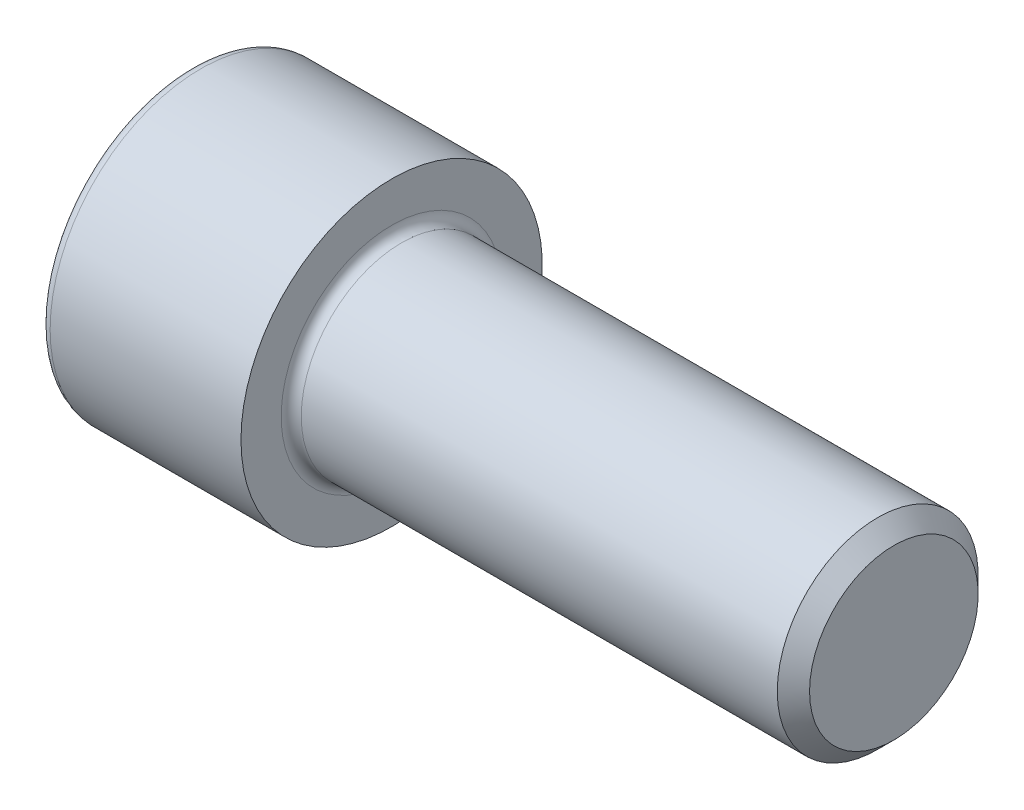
ISO-10303-21;
HEADER;
FILE_DESCRIPTION(('STEP AP214'),'2;1');
FILE_NAME('part.step','',(''),(''),'','','');
FILE_SCHEMA(('AUTOMOTIVE_DESIGN { 1 0 10303 214 1 1 1 1 }'));
ENDSEC;
DATA;
#1=APPLICATION_CONTEXT('core data for automotive mechanical design processes');
#2=APPLICATION_PROTOCOL_DEFINITION('international standard','automotive_design',2000,#1);
#3=PRODUCT_CONTEXT('',#1,'mechanical');
#4=PRODUCT('Part','Part','',(#3));
#5=PRODUCT_RELATED_PRODUCT_CATEGORY('part','',(#4));
#6=PRODUCT_DEFINITION_FORMATION('','',#4);
#7=PRODUCT_DEFINITION_CONTEXT('part definition',#1,'design');
#8=PRODUCT_DEFINITION('design','',#6,#7);
#9=PRODUCT_DEFINITION_SHAPE('','',#8);
#10=(LENGTH_UNIT() NAMED_UNIT(*) SI_UNIT(.MILLI.,.METRE.));
#11=(NAMED_UNIT(*) PLANE_ANGLE_UNIT() SI_UNIT($,.RADIAN.));
#12=(NAMED_UNIT(*) SI_UNIT($,.STERADIAN.) SOLID_ANGLE_UNIT());
#13=UNCERTAINTY_MEASURE_WITH_UNIT(LENGTH_MEASURE(1.E-05),#10,'distance_accuracy_value','');
#14=(GEOMETRIC_REPRESENTATION_CONTEXT(3) GLOBAL_UNCERTAINTY_ASSIGNED_CONTEXT((#13)) GLOBAL_UNIT_ASSIGNED_CONTEXT((#10,
#11,#12)) REPRESENTATION_CONTEXT('',''));
#15=CARTESIAN_POINT('',(0.,0.,0.));
#16=DIRECTION('',(0.,0.,1.));
#17=DIRECTION('',(1.,0.,0.));
#18=AXIS2_PLACEMENT_3D('',#15,#16,#17);
#19=CARTESIAN_POINT('',(0.,0.,0.));
#20=DIRECTION('',(-1.,0.,0.));
#21=DIRECTION('',(0.,0.,1.));
#22=AXIS2_PLACEMENT_3D('',#19,#20,#21);
#23=PLANE('',#22);
#24=DIRECTION('',(0.,-0.499999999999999,0.866025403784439));
#25=VECTOR('',#24,1.);
#26=CARTESIAN_POINT('',(0.,5.83989797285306,0.));
#27=LINE('',#26,#25);
#28=CARTESIAN_POINT('',(0.,5.83989797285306,0.));
#29=VERTEX_POINT('',#28);
#30=CARTESIAN_POINT('',(0.,2.91994898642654,5.05749999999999));
#31=VERTEX_POINT('',#30);
#32=EDGE_CURVE('E258',#29,#31,#27,.T.);
#33=ORIENTED_EDGE('',*,*,#32,.T.);
#34=DIRECTION('',(0.,1.,0.));
#35=VECTOR('',#34,1.);
#36=CARTESIAN_POINT('',(0.,-2.91994898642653,5.0575));
#37=LINE('',#36,#35);
#38=CARTESIAN_POINT('',(0.,-2.91994898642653,5.0575));
#39=VERTEX_POINT('',#38);
#40=EDGE_CURVE('E130',#39,#31,#37,.T.);
#41=ORIENTED_EDGE('',*,*,#40,.F.);
#42=DIRECTION('',(0.,-0.500000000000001,-0.866025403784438));
#43=VECTOR('',#42,1.);
#44=CARTESIAN_POINT('',(0.,-2.91994898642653,5.0575));
#45=LINE('',#44,#43);
#46=CARTESIAN_POINT('',(0.,-5.83989797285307,0.));
#47=VERTEX_POINT('',#46);
#48=EDGE_CURVE('E261',#39,#47,#45,.T.);
#49=ORIENTED_EDGE('',*,*,#48,.T.);
#50=DIRECTION('',(0.,0.499999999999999,-0.866025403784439));
#51=VECTOR('',#50,1.);
#52=CARTESIAN_POINT('',(0.,-5.83989797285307,0.));
#53=LINE('',#52,#51);
#54=CARTESIAN_POINT('',(0.,-2.91994898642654,-5.0575));
#55=VERTEX_POINT('',#54);
#56=EDGE_CURVE('E264',#47,#55,#53,.T.);
#57=ORIENTED_EDGE('',*,*,#56,.T.);
#58=DIRECTION('',(0.,-1.,0.));
#59=VECTOR('',#58,1.);
#60=CARTESIAN_POINT('',(0.,2.91994898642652,-5.05750000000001));
#61=LINE('',#60,#59);
#62=CARTESIAN_POINT('',(0.,2.91994898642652,-5.05750000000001));
#63=VERTEX_POINT('',#62);
#64=EDGE_CURVE('E267',#63,#55,#61,.T.);
#65=ORIENTED_EDGE('',*,*,#64,.F.);
#66=DIRECTION('',(0.,-0.500000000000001,-0.866025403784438));
#67=VECTOR('',#66,1.);
#68=CARTESIAN_POINT('',(0.,5.83989797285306,0.));
#69=LINE('',#68,#67);
#70=EDGE_CURVE('E125',#29,#63,#69,.T.);
#71=ORIENTED_EDGE('',*,*,#70,.F.);
#72=EDGE_LOOP('',(#33,#41,#49,#57,#65,#71));
#73=FACE_BOUND('',#72,.T.);
#74=CARTESIAN_POINT('',(0.,0.,0.));
#75=DIRECTION('',(-1.,0.,0.));
#76=DIRECTION('',(0.,0.,1.));
#77=AXIS2_PLACEMENT_3D('',#74,#75,#76);
#78=CIRCLE('',#77,8.4);
#79=CARTESIAN_POINT('',(0.,0.,8.4));
#80=VERTEX_POINT('',#79);
#81=EDGE_CURVE('E42',#80,#80,#78,.T.);
#82=ORIENTED_EDGE('',*,*,#81,.T.);
#83=EDGE_LOOP('',(#82));
#84=FACE_BOUND('',#83,.T.);
#85=ADVANCED_FACE('F34',(#73,#84),#23,.T.);
#86=CARTESIAN_POINT('',(-31.75,0.,0.));
#87=DIRECTION('',(-1.,0.,0.));
#88=DIRECTION('',(0.,0.,1.));
#89=AXIS2_PLACEMENT_3D('',#86,#87,#88);
#90=CYLINDRICAL_SURFACE('',#89,9.);
#91=CARTESIAN_POINT('',(0.600000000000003,0.,0.));
#92=DIRECTION('',(-1.,0.,0.));
#93=DIRECTION('',(0.,0.,1.));
#94=AXIS2_PLACEMENT_3D('',#91,#92,#93);
#95=CIRCLE('',#94,9.);
#96=CARTESIAN_POINT('',(0.600000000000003,0.,9.));
#97=VERTEX_POINT('',#96);
#98=EDGE_CURVE('E11',#97,#97,#95,.F.);
#99=ORIENTED_EDGE('',*,*,#98,.T.);
#100=EDGE_LOOP('',(#99));
#101=FACE_BOUND('',#100,.T.);
#102=CARTESIAN_POINT('',(12.,0.,0.));
#103=DIRECTION('',(-1.,0.,0.));
#104=DIRECTION('',(0.,0.,1.));
#105=AXIS2_PLACEMENT_3D('',#102,#103,#104);
#106=CIRCLE('',#105,9.);
#107=CARTESIAN_POINT('',(12.,0.,9.));
#108=VERTEX_POINT('',#107);
#109=EDGE_CURVE('E148',#108,#108,#106,.T.);
#110=ORIENTED_EDGE('',*,*,#109,.T.);
#111=EDGE_LOOP('',(#110));
#112=FACE_BOUND('',#111,.T.);
#113=ADVANCED_FACE('F172',(#101,#112),#90,.T.);
#114=CARTESIAN_POINT('',(12.,9.,0.));
#115=DIRECTION('',(1.,0.,0.));
#116=DIRECTION('',(0.,0.,-1.));
#117=AXIS2_PLACEMENT_3D('',#114,#115,#116);
#118=PLANE('',#117);
#119=CARTESIAN_POINT('',(12.,0.,0.));
#120=DIRECTION('',(1.,0.,0.));
#121=DIRECTION('',(0.,0.,-1.));
#122=AXIS2_PLACEMENT_3D('',#119,#120,#121);
#123=CIRCLE('',#122,6.6);
#124=CARTESIAN_POINT('',(12.,0.,-6.6));
#125=VERTEX_POINT('',#124);
#126=EDGE_CURVE('E151',#125,#125,#123,.F.);
#127=ORIENTED_EDGE('',*,*,#126,.T.);
#128=EDGE_LOOP('',(#127));
#129=FACE_BOUND('',#128,.T.);
#130=ORIENTED_EDGE('',*,*,#109,.F.);
#131=EDGE_LOOP('',(#130));
#132=FACE_BOUND('',#131,.T.);
#133=ADVANCED_FACE('F178',(#129,#132),#118,.T.);
#134=CARTESIAN_POINT('',(-31.75,0.,0.));
#135=DIRECTION('',(-1.,0.,0.));
#136=DIRECTION('',(0.,0.,1.));
#137=AXIS2_PLACEMENT_3D('',#134,#135,#136);
#138=CYLINDRICAL_SURFACE('',#137,6.);
#139=CARTESIAN_POINT('',(12.6,0.,0.));
#140=DIRECTION('',(1.,0.,0.));
#141=DIRECTION('',(0.,0.,-1.));
#142=AXIS2_PLACEMENT_3D('',#139,#140,#141);
#143=CIRCLE('',#142,6.);
#144=CARTESIAN_POINT('',(12.6,0.,-6.));
#145=VERTEX_POINT('',#144);
#146=EDGE_CURVE('E154',#145,#145,#143,.T.);
#147=ORIENTED_EDGE('',*,*,#146,.T.);
#148=EDGE_LOOP('',(#147));
#149=FACE_BOUND('',#148,.T.);
#150=CARTESIAN_POINT('',(41.036,0.,0.));
#151=DIRECTION('',(-1.,0.,0.));
#152=DIRECTION('',(0.,0.,1.));
#153=AXIS2_PLACEMENT_3D('',#150,#151,#152);
#154=CIRCLE('',#153,6.);
#155=CARTESIAN_POINT('',(41.036,0.,6.));
#156=VERTEX_POINT('',#155);
#157=EDGE_CURVE('E145',#156,#156,#154,.T.);
#158=ORIENTED_EDGE('',*,*,#157,.T.);
#159=EDGE_LOOP('',(#158));
#160=FACE_BOUND('',#159,.T.);
#161=ADVANCED_FACE('F184',(#149,#160),#138,.T.);
#162=CARTESIAN_POINT('',(42.,0.,0.));
#163=DIRECTION('',(-1.,0.,0.));
#164=DIRECTION('',(0.,0.,1.));
#165=AXIS2_PLACEMENT_3D('',#162,#163,#164);
#166=CONICAL_SURFACE('',#165,5.036,0.785398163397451);
#167=ORIENTED_EDGE('',*,*,#157,.F.);
#168=EDGE_LOOP('',(#167));
#169=FACE_BOUND('',#168,.T.);
#170=CARTESIAN_POINT('',(42.,0.,0.));
#171=DIRECTION('',(-1.,0.,0.));
#172=DIRECTION('',(0.,0.,1.));
#173=AXIS2_PLACEMENT_3D('',#170,#171,#172);
#174=CIRCLE('',#173,5.036);
#175=CARTESIAN_POINT('',(42.,0.,5.036));
#176=VERTEX_POINT('',#175);
#177=EDGE_CURVE('E141',#176,#176,#174,.T.);
#178=ORIENTED_EDGE('',*,*,#177,.T.);
#179=EDGE_LOOP('',(#178));
#180=FACE_BOUND('',#179,.T.);
#181=ADVANCED_FACE('F188',(#169,#180),#166,.T.);
#182=CARTESIAN_POINT('',(42.,5.036,0.));
#183=DIRECTION('',(1.,0.,0.));
#184=DIRECTION('',(0.,0.,-1.));
#185=AXIS2_PLACEMENT_3D('',#182,#183,#184);
#186=PLANE('',#185);
#187=ORIENTED_EDGE('',*,*,#177,.F.);
#188=EDGE_LOOP('',(#187));
#189=FACE_BOUND('',#188,.T.);
#190=ADVANCED_FACE('F168',(#189),#186,.T.);
#191=CARTESIAN_POINT('',(12.6,0.,0.));
#192=DIRECTION('',(1.,0.,0.));
#193=DIRECTION('',(0.,0.,-1.));
#194=AXIS2_PLACEMENT_3D('',#191,#192,#193);
#195=TOROIDAL_SURFACE('',#194,6.6,0.6);
#196=ORIENTED_EDGE('',*,*,#146,.F.);
#197=EDGE_LOOP('',(#196));
#198=FACE_BOUND('',#197,.T.);
#199=ORIENTED_EDGE('',*,*,#126,.F.);
#200=EDGE_LOOP('',(#199));
#201=FACE_BOUND('',#200,.T.);
#202=ADVANCED_FACE('F161',(#198,#201),#195,.F.);
#203=CARTESIAN_POINT('',(0.600000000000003,0.,0.));
#204=DIRECTION('',(-1.,0.,0.));
#205=DIRECTION('',(0.,0.,1.));
#206=AXIS2_PLACEMENT_3D('',#203,#204,#205);
#207=TOROIDAL_SURFACE('',#206,8.4,0.6);
#208=ORIENTED_EDGE('',*,*,#98,.F.);
#209=EDGE_LOOP('',(#208));
#210=FACE_BOUND('',#209,.T.);
#211=ORIENTED_EDGE('',*,*,#81,.F.);
#212=EDGE_LOOP('',(#211));
#213=FACE_BOUND('',#212,.T.);
#214=ADVANCED_FACE('F36',(#210,#213),#207,.T.);
#215=CARTESIAN_POINT('',(6.,5.83989797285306,0.));
#216=DIRECTION('',(0.,-0.866025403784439,-0.499999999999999));
#217=DIRECTION('',(0.,0.499999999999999,-0.866025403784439));
#218=AXIS2_PLACEMENT_3D('',#215,#216,#217);
#219=PLANE('',#218);
#220=ORIENTED_EDGE('',*,*,#32,.F.);
#221=DIRECTION('',(-1.,0.,0.));
#222=VECTOR('',#221,1.);
#223=CARTESIAN_POINT('',(6.,5.83989797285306,0.));
#224=LINE('',#223,#222);
#225=CARTESIAN_POINT('',(6.,5.83989797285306,0.));
#226=VERTEX_POINT('',#225);
#227=EDGE_CURVE('E248',#226,#29,#224,.T.);
#228=ORIENTED_EDGE('',*,*,#227,.F.);
#229=DIRECTION('',(0.,-0.499999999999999,0.866025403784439));
#230=VECTOR('',#229,1.);
#231=CARTESIAN_POINT('',(6.,5.83989797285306,0.));
#232=LINE('',#231,#230);
#233=CARTESIAN_POINT('',(6.,4.3799234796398,2.52874999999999));
#234=VERTEX_POINT('',#233);
#235=EDGE_CURVE('E117',#226,#234,#232,.T.);
#236=ORIENTED_EDGE('',*,*,#235,.T.);
#237=CARTESIAN_POINT('',(6.,2.91994898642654,5.05749999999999));
#238=VERTEX_POINT('',#237);
#239=EDGE_CURVE('E108',#234,#238,#232,.T.);
#240=ORIENTED_EDGE('',*,*,#239,.T.);
#241=DIRECTION('',(-1.,0.,0.));
#242=VECTOR('',#241,1.);
#243=CARTESIAN_POINT('',(6.,2.91994898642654,5.05749999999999));
#244=LINE('',#243,#242);
#245=EDGE_CURVE('E122',#238,#31,#244,.T.);
#246=ORIENTED_EDGE('',*,*,#245,.T.);
#247=EDGE_LOOP('',(#220,#228,#236,#240,#246));
#248=FACE_BOUND('',#247,.T.);
#249=ADVANCED_FACE('F121',(#248),#219,.T.);
#250=CARTESIAN_POINT('',(6.,-2.91994898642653,5.0575));
#251=DIRECTION('',(0.,0.,1.));
#252=DIRECTION('',(0.,-1.,0.));
#253=AXIS2_PLACEMENT_3D('',#250,#251,#252);
#254=PLANE('',#253);
#255=ORIENTED_EDGE('',*,*,#40,.T.);
#256=ORIENTED_EDGE('',*,*,#245,.F.);
#257=DIRECTION('',(0.,1.,0.));
#258=VECTOR('',#257,1.);
#259=CARTESIAN_POINT('',(6.,-2.91994898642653,5.0575));
#260=LINE('',#259,#258);
#261=CARTESIAN_POINT('',(6.,0.,5.0575));
#262=VERTEX_POINT('',#261);
#263=EDGE_CURVE('E105',#262,#238,#260,.T.);
#264=ORIENTED_EDGE('',*,*,#263,.F.);
#265=CARTESIAN_POINT('',(6.,-2.91994898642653,5.0575));
#266=VERTEX_POINT('',#265);
#267=EDGE_CURVE('E116',#266,#262,#260,.T.);
#268=ORIENTED_EDGE('',*,*,#267,.F.);
#269=DIRECTION('',(-1.,0.,0.));
#270=VECTOR('',#269,1.);
#271=CARTESIAN_POINT('',(6.,-2.91994898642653,5.0575));
#272=LINE('',#271,#270);
#273=EDGE_CURVE('E132',#266,#39,#272,.T.);
#274=ORIENTED_EDGE('',*,*,#273,.T.);
#275=EDGE_LOOP('',(#255,#256,#264,#268,#274));
#276=FACE_BOUND('',#275,.T.);
#277=ADVANCED_FACE('F127',(#276),#254,.F.);
#278=CARTESIAN_POINT('',(6.,-2.91994898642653,5.0575));
#279=DIRECTION('',(0.,0.866025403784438,-0.500000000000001));
#280=DIRECTION('',(0.,0.500000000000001,0.866025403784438));
#281=AXIS2_PLACEMENT_3D('',#278,#279,#280);
#282=PLANE('',#281);
#283=ORIENTED_EDGE('',*,*,#48,.F.);
#284=ORIENTED_EDGE('',*,*,#273,.F.);
#285=DIRECTION('',(0.,-0.500000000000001,-0.866025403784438));
#286=VECTOR('',#285,1.);
#287=CARTESIAN_POINT('',(6.,-2.91994898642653,5.0575));
#288=LINE('',#287,#286);
#289=CARTESIAN_POINT('',(6.,-4.3799234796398,2.52875000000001));
#290=VERTEX_POINT('',#289);
#291=EDGE_CURVE('E287',#266,#290,#288,.T.);
#292=ORIENTED_EDGE('',*,*,#291,.T.);
#293=CARTESIAN_POINT('',(6.,-5.83989797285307,0.));
#294=VERTEX_POINT('',#293);
#295=EDGE_CURVE('E276',#290,#294,#288,.T.);
#296=ORIENTED_EDGE('',*,*,#295,.T.);
#297=DIRECTION('',(-1.,0.,0.));
#298=VECTOR('',#297,1.);
#299=CARTESIAN_POINT('',(6.,-5.83989797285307,0.));
#300=LINE('',#299,#298);
#301=EDGE_CURVE('E137',#294,#47,#300,.T.);
#302=ORIENTED_EDGE('',*,*,#301,.T.);
#303=EDGE_LOOP('',(#283,#284,#292,#296,#302));
#304=FACE_BOUND('',#303,.T.);
#305=ADVANCED_FACE('F202',(#304),#282,.T.);
#306=CARTESIAN_POINT('',(6.,-5.83989797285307,0.));
#307=DIRECTION('',(0.,0.866025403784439,0.499999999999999));
#308=DIRECTION('',(0.,-0.499999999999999,0.866025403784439));
#309=AXIS2_PLACEMENT_3D('',#306,#307,#308);
#310=PLANE('',#309);
#311=ORIENTED_EDGE('',*,*,#56,.F.);
#312=ORIENTED_EDGE('',*,*,#301,.F.);
#313=DIRECTION('',(0.,0.499999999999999,-0.866025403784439));
#314=VECTOR('',#313,1.);
#315=CARTESIAN_POINT('',(6.,-5.83989797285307,0.));
#316=LINE('',#315,#314);
#317=CARTESIAN_POINT('',(6.,-4.37992347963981,-2.52875));
#318=VERTEX_POINT('',#317);
#319=EDGE_CURVE('E254',#294,#318,#316,.T.);
#320=ORIENTED_EDGE('',*,*,#319,.T.);
#321=CARTESIAN_POINT('',(6.,-2.91994898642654,-5.0575));
#322=VERTEX_POINT('',#321);
#323=EDGE_CURVE('E286',#318,#322,#316,.T.);
#324=ORIENTED_EDGE('',*,*,#323,.T.);
#325=DIRECTION('',(-1.,0.,0.));
#326=VECTOR('',#325,1.);
#327=CARTESIAN_POINT('',(6.,-2.91994898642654,-5.0575));
#328=LINE('',#327,#326);
#329=EDGE_CURVE('E247',#322,#55,#328,.T.);
#330=ORIENTED_EDGE('',*,*,#329,.T.);
#331=EDGE_LOOP('',(#311,#312,#320,#324,#330));
#332=FACE_BOUND('',#331,.T.);
#333=ADVANCED_FACE('F205',(#332),#310,.T.);
#334=CARTESIAN_POINT('',(6.,2.91994898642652,-5.05750000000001));
#335=DIRECTION('',(0.,0.,-1.));
#336=DIRECTION('',(0.,1.,0.));
#337=AXIS2_PLACEMENT_3D('',#334,#335,#336);
#338=PLANE('',#337);
#339=ORIENTED_EDGE('',*,*,#64,.T.);
#340=ORIENTED_EDGE('',*,*,#329,.F.);
#341=DIRECTION('',(0.,-1.,0.));
#342=VECTOR('',#341,1.);
#343=CARTESIAN_POINT('',(6.,2.91994898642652,-5.05750000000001));
#344=LINE('',#343,#342);
#345=CARTESIAN_POINT('',(6.,0.,-5.0575));
#346=VERTEX_POINT('',#345);
#347=EDGE_CURVE('E251',#346,#322,#344,.T.);
#348=ORIENTED_EDGE('',*,*,#347,.F.);
#349=CARTESIAN_POINT('',(6.,2.91994898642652,-5.05750000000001));
#350=VERTEX_POINT('',#349);
#351=EDGE_CURVE('E49',#350,#346,#344,.T.);
#352=ORIENTED_EDGE('',*,*,#351,.F.);
#353=DIRECTION('',(-1.,0.,0.));
#354=VECTOR('',#353,1.);
#355=CARTESIAN_POINT('',(6.,2.91994898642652,-5.05750000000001));
#356=LINE('',#355,#354);
#357=EDGE_CURVE('E244',#350,#63,#356,.T.);
#358=ORIENTED_EDGE('',*,*,#357,.T.);
#359=EDGE_LOOP('',(#339,#340,#348,#352,#358));
#360=FACE_BOUND('',#359,.T.);
#361=ADVANCED_FACE('F209',(#360),#338,.F.);
#362=CARTESIAN_POINT('',(6.,5.83989797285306,0.));
#363=DIRECTION('',(0.,0.866025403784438,-0.500000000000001));
#364=DIRECTION('',(0.,0.500000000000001,0.866025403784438));
#365=AXIS2_PLACEMENT_3D('',#362,#363,#364);
#366=PLANE('',#365);
#367=ORIENTED_EDGE('',*,*,#70,.T.);
#368=ORIENTED_EDGE('',*,*,#357,.F.);
#369=DIRECTION('',(0.,-0.500000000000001,-0.866025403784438));
#370=VECTOR('',#369,1.);
#371=CARTESIAN_POINT('',(6.,5.83989797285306,0.));
#372=LINE('',#371,#370);
#373=CARTESIAN_POINT('',(6.,4.37992347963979,-2.52875000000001));
#374=VERTEX_POINT('',#373);
#375=EDGE_CURVE('E234',#374,#350,#372,.T.);
#376=ORIENTED_EDGE('',*,*,#375,.F.);
#377=EDGE_CURVE('E240',#226,#374,#372,.T.);
#378=ORIENTED_EDGE('',*,*,#377,.F.);
#379=ORIENTED_EDGE('',*,*,#227,.T.);
#380=EDGE_LOOP('',(#367,#368,#376,#378,#379));
#381=FACE_BOUND('',#380,.T.);
#382=ADVANCED_FACE('F213',(#381),#366,.F.);
#383=CARTESIAN_POINT('',(6.,5.83989797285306,0.));
#384=DIRECTION('',(1.,0.,0.));
#385=DIRECTION('',(0.,0.,-1.));
#386=AXIS2_PLACEMENT_3D('',#383,#384,#385);
#387=PLANE('',#386);
#388=ORIENTED_EDGE('',*,*,#347,.T.);
#389=ORIENTED_EDGE('',*,*,#323,.F.);
#390=CARTESIAN_POINT('',(6.,0.,0.));
#391=DIRECTION('',(-1.,0.,0.));
#392=DIRECTION('',(0.,0.,1.));
#393=AXIS2_PLACEMENT_3D('',#390,#391,#392);
#394=CIRCLE('',#393,5.0575);
#395=EDGE_CURVE('E282',#346,#318,#394,.T.);
#396=ORIENTED_EDGE('',*,*,#395,.F.);
#397=EDGE_LOOP('',(#388,#389,#396));
#398=FACE_BOUND('',#397,.T.);
#399=ADVANCED_FACE('F217',(#398),#387,.F.);
#400=ORIENTED_EDGE('',*,*,#319,.F.);
#401=ORIENTED_EDGE('',*,*,#295,.F.);
#402=EDGE_CURVE('E135',#318,#290,#394,.T.);
#403=ORIENTED_EDGE('',*,*,#402,.F.);
#404=EDGE_LOOP('',(#400,#401,#403));
#405=FACE_BOUND('',#404,.T.);
#406=ADVANCED_FACE('F220',(#405),#387,.F.);
#407=ORIENTED_EDGE('',*,*,#291,.F.);
#408=ORIENTED_EDGE('',*,*,#267,.T.);
#409=EDGE_CURVE('E131',#290,#262,#394,.T.);
#410=ORIENTED_EDGE('',*,*,#409,.F.);
#411=EDGE_LOOP('',(#407,#408,#410));
#412=FACE_BOUND('',#411,.T.);
#413=ADVANCED_FACE('F225',(#412),#387,.F.);
#414=ORIENTED_EDGE('',*,*,#263,.T.);
#415=ORIENTED_EDGE('',*,*,#239,.F.);
#416=EDGE_CURVE('E111',#262,#234,#394,.T.);
#417=ORIENTED_EDGE('',*,*,#416,.F.);
#418=EDGE_LOOP('',(#414,#415,#417));
#419=FACE_BOUND('',#418,.T.);
#420=ADVANCED_FACE('F107',(#419),#387,.F.);
#421=ORIENTED_EDGE('',*,*,#235,.F.);
#422=ORIENTED_EDGE('',*,*,#377,.T.);
#423=EDGE_CURVE('E142',#234,#374,#394,.T.);
#424=ORIENTED_EDGE('',*,*,#423,.F.);
#425=EDGE_LOOP('',(#421,#422,#424));
#426=FACE_BOUND('',#425,.T.);
#427=ADVANCED_FACE('F228',(#426),#387,.F.);
#428=ORIENTED_EDGE('',*,*,#375,.T.);
#429=ORIENTED_EDGE('',*,*,#351,.T.);
#430=EDGE_CURVE('E237',#374,#346,#394,.T.);
#431=ORIENTED_EDGE('',*,*,#430,.F.);
#432=EDGE_LOOP('',(#428,#429,#431));
#433=FACE_BOUND('',#432,.T.);
#434=ADVANCED_FACE('F198',(#433),#387,.F.);
#435=CARTESIAN_POINT('',(6.,0.,0.));
#436=DIRECTION('',(-1.,0.,0.));
#437=DIRECTION('',(0.,0.,1.));
#438=AXIS2_PLACEMENT_3D('',#435,#436,#437);
#439=CONICAL_SURFACE('',#438,5.0575,1.04719755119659);
#440=CARTESIAN_POINT('',(8.91994898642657,0.,0.));
#441=VERTEX_POINT('',#440);
#442=VERTEX_LOOP('',#441);
#443=FACE_BOUND('',#442,.T.);
#444=ORIENTED_EDGE('',*,*,#416,.T.);
#445=ORIENTED_EDGE('',*,*,#423,.T.);
#446=ORIENTED_EDGE('',*,*,#430,.T.);
#447=ORIENTED_EDGE('',*,*,#395,.T.);
#448=ORIENTED_EDGE('',*,*,#402,.T.);
#449=ORIENTED_EDGE('',*,*,#409,.T.);
#450=EDGE_LOOP('',(#444,#445,#446,#447,#448,#449));
#451=FACE_BOUND('',#450,.T.);
#452=ADVANCED_FACE('F196',(#443,#451),#439,.F.);
#453=CLOSED_SHELL('',(#85,#113,#133,#161,#181,#190,#202,#214,#249,#277,#305,#333,#361,#382,#399,
#406,#413,#420,#427,#434,#452));
#454=MANIFOLD_SOLID_BREP('B2',#453);
#455=ADVANCED_BREP_SHAPE_REPRESENTATION('',(#18,#454),#14);
#456=SHAPE_DEFINITION_REPRESENTATION(#9,#455);
ENDSEC;
END-ISO-10303-21;
